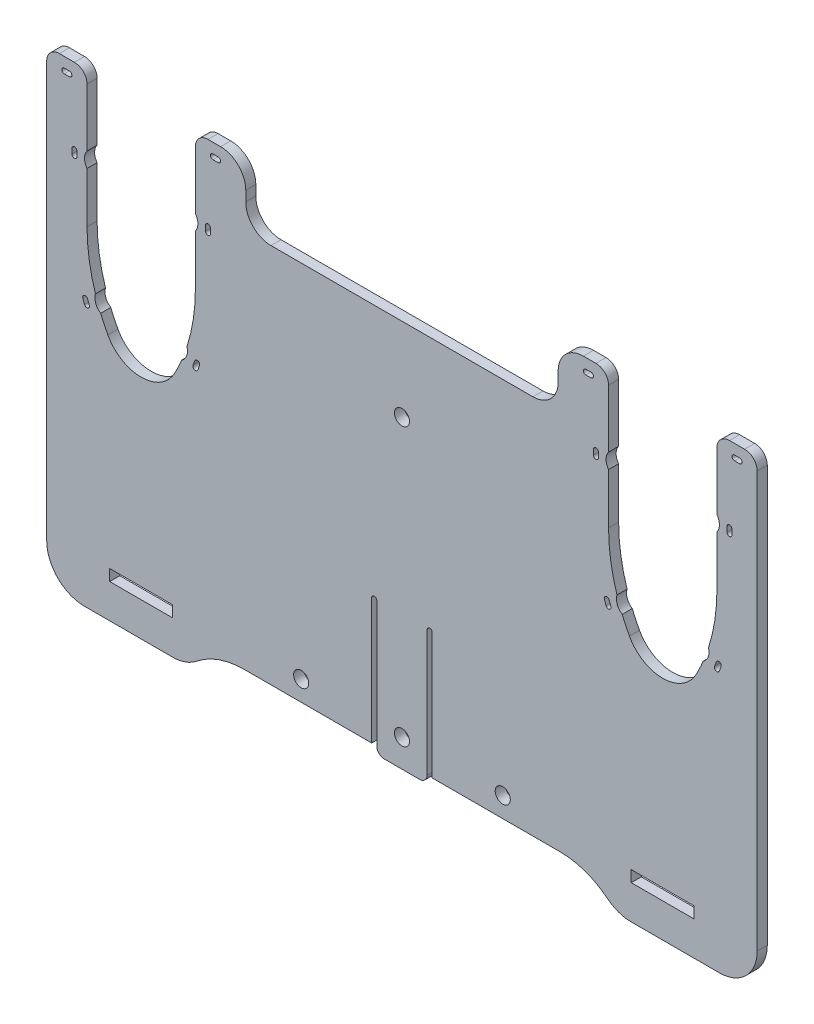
from build123d import *

# Parameters (mm, degrees)
SKETCH1_R      = 3
SKETCH1_W      = 25
SKETCH1_H      = 4.5
EXTRUDE1_DEPTH = 4


with BuildPart() as part:
    # Sketch1 → Extrude1 (new body)
    with BuildSketch(Plane.XY):
        with BuildLine():
            Line((0, 0), (0, 5))
            ThreePointArc((0, 5), (3, 8), (0, 11))
            Line((0, 11), (0, 115))
            ThreePointArc((0, 115), (3, 118), (0, 121))
            Line((0, 121), (0, 151))
            Line((0, 151), (52, 151))
            ThreePointArc((52, 151), (59.071067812, 153.928932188), (62, 161))
            Line((62, 161), (62, 165))
            ThreePointArc((62, 165), (64.928932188, 172.071067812), (72, 175))
            Line((72, 175), (77, 175))
            ThreePointArc((77, 175), (80.535533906, 173.535533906), (82, 170))
            Line((82, 170), (82, 147))
            ThreePointArc((82, 147), (81, 144), (82, 141))
            Line((82, 141), (82, 120.937424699))
            ThreePointArc((82, 120.937424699), (82.840573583, 110.121984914), (85.342106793, 99.566292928))
            ThreePointArc((85.342106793, 99.566292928), (85.441307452, 96.405571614), (87.417100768, 93.936514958))
            ThreePointArc((87.417100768, 93.936514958), (88.773455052, 90.89738452), (90.272727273, 87.9261569))
            ThreePointArc((90.272727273, 87.9261569), (103.5, 80), (116.727272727, 87.9261569))
            ThreePointArc((116.727272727, 87.9261569), (118.226544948, 90.89738452), (119.582899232, 93.936514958))
            ThreePointArc((119.582899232, 93.936514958), (121.558692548, 96.405571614), (121.657893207, 99.566292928))
            ThreePointArc((121.657893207, 99.566292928), (124.159426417, 110.121984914), (125, 120.937424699))
            Line((125, 120.937424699), (125, 141))
            ThreePointArc((125, 141), (126, 144), (125, 147))
            Line((125, 147), (125, 170))
            ThreePointArc((125, 170), (126.464466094, 173.535533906), (130, 175))
            Line((130, 175), (136, 175))
            ThreePointArc((136, 175), (139.535533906, 173.535533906), (141, 170))
            Line((141, 170), (141, 5))
            ThreePointArc((141, 5), (136.606601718, -5.606601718), (126, -10))
            Line((126, -10), (91, -10))
            ThreePointArc((91, -10), (86, -9.142135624), (81.571909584, -6.666666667))
            ThreePointArc((81.571909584, -6.666666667), (72.715728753, -1.715728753), (62.715728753, 0))
            Line((62.715728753, 0), (12, 0))
            Line((12, 0), (12, 50))
            ThreePointArc((12, 50), (11, 51), (10, 50))
            Line((10, 50), (10, 0))
            ThreePointArc((10, 0), (9.121320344, -2.121320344), (7, -3))
            Line((7, -3), (0, -3))
            Line((0, -3), (0, 0))
        make_face()
        with Locations((40, 8)):
            Circle(SKETCH1_R, mode=Mode.SUBTRACT)
        with BuildLine():
            Line((129, 143), (129, 145))
            ThreePointArc((129, 145), (130, 146), (131, 145))
            Line((131, 145), (131, 143))
            ThreePointArc((131, 143), (130, 142), (129, 143))
        make_face(mode=Mode.SUBTRACT)
        with BuildLine():
            Line((76, 143), (76, 145))
            ThreePointArc((76, 145), (77, 146), (78, 145))
            Line((78, 145), (78, 143))
            ThreePointArc((78, 143), (77, 142), (76, 143))
        make_face(mode=Mode.SUBTRACT)
        with BuildLine():
            Line((81.035311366, 93.715871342), (80.343646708, 95.592463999))
            ThreePointArc((80.343646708, 95.592463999), (80.936110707, 96.876592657), (82.220239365, 96.284128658))
            Line((82.220239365, 96.284128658), (82.911904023, 94.407536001))
            ThreePointArc((82.911904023, 94.407536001), (82.319440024, 93.123407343), (81.035311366, 93.715871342))
        make_face(mode=Mode.SUBTRACT)
        with BuildLine():
            Line((124.088095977, 94.407536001), (124.779760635, 96.284128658))
            ThreePointArc((124.779760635, 96.284128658), (126.063889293, 96.876592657), (126.656353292, 95.592463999))
            Line((126.656353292, 95.592463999), (125.964688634, 93.715871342))
            ThreePointArc((125.964688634, 93.715871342), (124.680559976, 93.123407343), (124.088095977, 94.407536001))
        make_face(mode=Mode.SUBTRACT)
        with BuildLine():
            Line((75, 169), (73, 169))
            ThreePointArc((73, 169), (72, 170), (73, 171))
            Line((73, 171), (75, 171))
            ThreePointArc((75, 171), (76, 170), (75, 169))
        make_face(mode=Mode.SUBTRACT)
        with BuildLine():
            Line((132, 171), (134, 171))
            ThreePointArc((134, 171), (135, 170), (134, 169))
            Line((134, 169), (132, 169))
            ThreePointArc((132, 169), (131, 170), (132, 171))
        make_face(mode=Mode.SUBTRACT)
        with Locations((103.5, 5.75)):
            Rectangle(SKETCH1_W, SKETCH1_H, mode=Mode.SUBTRACT)
    extrude1 = extrude(amount=EXTRUDE1_DEPTH)

    # Mirror1: Extrude1 across plane
    add(extrude1.mirror(Plane(origin=(0, 0, 0), x_dir=(0, 0, 1), z_dir=(1, 0, 0))))


solid = part.part
